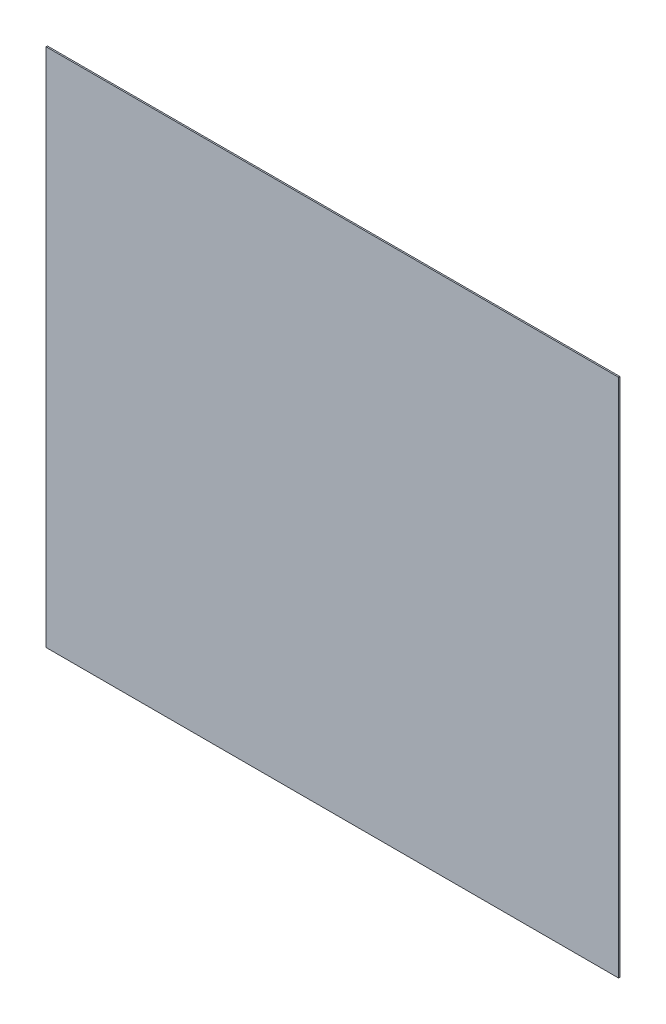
from build123d import *

# Parameters (mm, degrees)
MODEL_W                 = 210.000000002
MODEL_H                 = 189.999999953
BOSS_EXTRU_1_DEPTH      = 0.5
ESQUISSE1_W             = 16.386181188
ESQUISSE1_H             = 200.275547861
ENL_V_MAT_EXTRU_1_DEPTH = 1223.265438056


with BuildPart() as part:
    # Model → Boss.-Extru.1 (new body)
    with BuildSketch(Plane.XY):
        with Locations((927.384567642, 559.304711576)):
            Rectangle(MODEL_W, MODEL_H)
    extrude(amount=BOSS_EXTRU_1_DEPTH)

    # Esquisse1 → Enl_v. mat.-Extru.1 (cut, through all)
    with BuildSketch(Plane.XY.offset(0.5)):
        with Locations((815.191477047, 559.56480969)):
            Rectangle(ESQUISSE1_W, ESQUISSE1_H)
    extrude(amount=-ENL_V_MAT_EXTRU_1_DEPTH, mode=Mode.SUBTRACT)


solid = part.part
